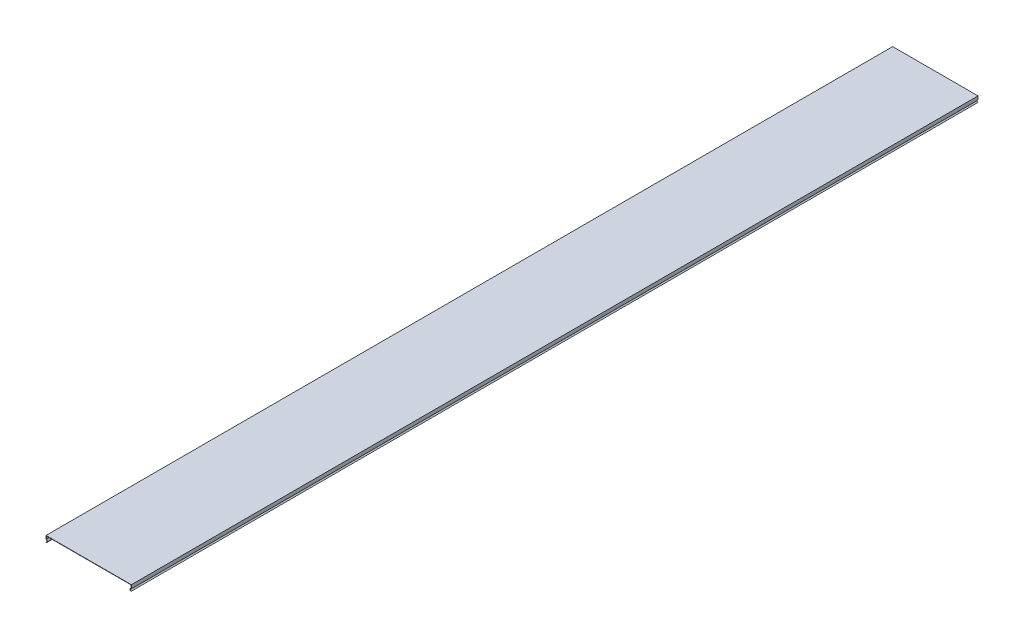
from build123d import *

# Parameters (mm, degrees)
EXTRUDE1_DEPTH = 3000


with BuildPart() as part:
    # Sketch1 → Extrude1 (new body)
    with BuildSketch(Plane.XY):
        with BuildLine():
            Line((0, 0), (302.428, 0))
            Line((302.428, 0), (302.428, -12.428))
            ThreePointArc((302.428, -12.428), (298.642, -16.214), (302.428, -20))
            Line((302.428, -20), (301.334940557, -21.093059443))
            ThreePointArc((301.334940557, -21.093059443), (297.42838624, -16.27614705), (301.214, -11.363618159))
            Line((301.214, -11.363618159), (301.214, -1.214))
            Line((301.214, -1.214), (1.214, -1.214))
            Line((1.214, -1.214), (1.214, -11.363618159))
            ThreePointArc((1.214, -11.363618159), (4.99961376, -16.27614705), (1.093059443, -21.093059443))
            Line((1.093059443, -21.093059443), (0, -20))
            ThreePointArc((0, -20), (3.786, -16.214), (0, -12.428))
            Line((0, -12.428), (0, 0))
        make_face()
    extrude(amount=EXTRUDE1_DEPTH)


solid = part.part
